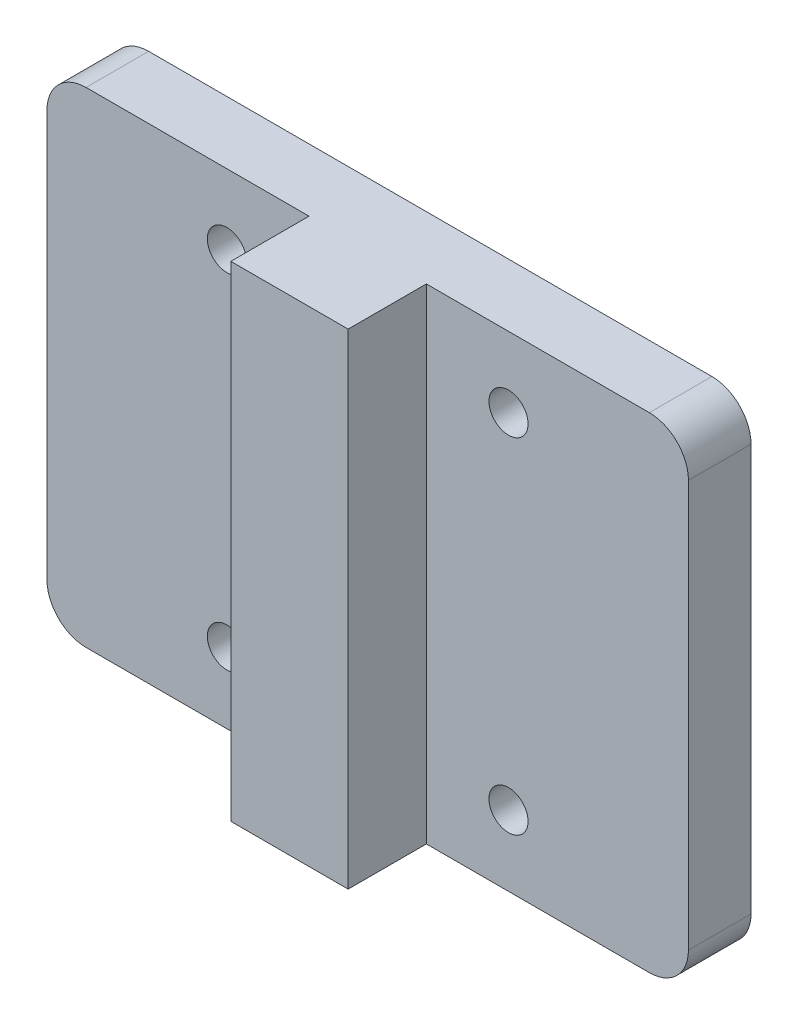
ISO-10303-21;
HEADER;
FILE_DESCRIPTION(('STEP AP214'),'2;1');
FILE_NAME('part.step','',(''),(''),'','','');
FILE_SCHEMA(('AUTOMOTIVE_DESIGN { 1 0 10303 214 1 1 1 1 }'));
ENDSEC;
DATA;
#1=APPLICATION_CONTEXT('core data for automotive mechanical design processes');
#2=APPLICATION_PROTOCOL_DEFINITION('international standard','automotive_design',2000,#1);
#3=PRODUCT_CONTEXT('',#1,'mechanical');
#4=PRODUCT('Part','Part','',(#3));
#5=PRODUCT_RELATED_PRODUCT_CATEGORY('part','',(#4));
#6=PRODUCT_DEFINITION_FORMATION('','',#4);
#7=PRODUCT_DEFINITION_CONTEXT('part definition',#1,'design');
#8=PRODUCT_DEFINITION('design','',#6,#7);
#9=PRODUCT_DEFINITION_SHAPE('','',#8);
#10=(LENGTH_UNIT() NAMED_UNIT(*) SI_UNIT(.MILLI.,.METRE.));
#11=(NAMED_UNIT(*) PLANE_ANGLE_UNIT() SI_UNIT($,.RADIAN.));
#12=(NAMED_UNIT(*) SI_UNIT($,.STERADIAN.) SOLID_ANGLE_UNIT());
#13=UNCERTAINTY_MEASURE_WITH_UNIT(LENGTH_MEASURE(1.E-05),#10,'distance_accuracy_value','');
#14=(GEOMETRIC_REPRESENTATION_CONTEXT(3) GLOBAL_UNCERTAINTY_ASSIGNED_CONTEXT((#13)) GLOBAL_UNIT_ASSIGNED_CONTEXT((#10,
#11,#12)) REPRESENTATION_CONTEXT('',''));
#15=CARTESIAN_POINT('',(0.,0.,0.));
#16=DIRECTION('',(0.,0.,1.));
#17=DIRECTION('',(1.,0.,0.));
#18=AXIS2_PLACEMENT_3D('',#15,#16,#17);
#19=CARTESIAN_POINT('',(0.,0.,0.));
#20=DIRECTION('',(0.,0.,-1.));
#21=DIRECTION('',(-1.,0.,0.));
#22=AXIS2_PLACEMENT_3D('',#19,#20,#21);
#23=PLANE('',#22);
#24=CARTESIAN_POINT('',(-76.592247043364,0.554599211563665,0.));
#25=DIRECTION('',(0.,0.,1.));
#26=DIRECTION('',(1.,0.,0.));
#27=AXIS2_PLACEMENT_3D('',#24,#25,#26);
#28=CIRCLE('',#27,2.5);
#29=CARTESIAN_POINT('',(-74.092247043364,0.554599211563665,0.));
#30=VERTEX_POINT('',#29);
#31=EDGE_CURVE('E176',#30,#30,#28,.T.);
#32=ORIENTED_EDGE('',*,*,#31,.F.);
#33=EDGE_LOOP('',(#32));
#34=FACE_BOUND('',#33,.T.);
#35=CARTESIAN_POINT('',(-76.592247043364,44.5545992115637,0.));
#36=DIRECTION('',(0.,0.,1.));
#37=DIRECTION('',(1.,0.,0.));
#38=AXIS2_PLACEMENT_3D('',#35,#36,#37);
#39=CIRCLE('',#38,2.5);
#40=CARTESIAN_POINT('',(-74.092247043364,44.5545992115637,0.));
#41=VERTEX_POINT('',#40);
#42=EDGE_CURVE('E167',#41,#41,#39,.T.);
#43=ORIENTED_EDGE('',*,*,#42,.F.);
#44=EDGE_LOOP('',(#43));
#45=FACE_BOUND('',#44,.T.);
#46=DIRECTION('',(0.,-1.,0.));
#47=VECTOR('',#46,1.);
#48=CARTESIAN_POINT('',(-66.092247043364,53.5545992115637,0.));
#49=LINE('',#48,#47);
#50=CARTESIAN_POINT('',(-66.0922470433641,53.5545992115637,0.));
#51=VERTEX_POINT('',#50);
#52=CARTESIAN_POINT('',(-66.0922470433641,-8.44540078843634,0.));
#53=VERTEX_POINT('',#52);
#54=EDGE_CURVE('E128',#51,#53,#49,.T.);
#55=ORIENTED_EDGE('',*,*,#54,.F.);
#56=DIRECTION('',(-1.,0.,0.));
#57=VECTOR('',#56,1.);
#58=CARTESIAN_POINT('',(-99.592247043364,53.5545992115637,0.));
#59=LINE('',#58,#57);
#60=CARTESIAN_POINT('',(-94.592247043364,53.5545992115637,0.));
#61=VERTEX_POINT('',#60);
#62=EDGE_CURVE('E129',#51,#61,#59,.T.);
#63=ORIENTED_EDGE('',*,*,#62,.T.);
#64=CARTESIAN_POINT('',(-94.592247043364,48.5545992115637,0.));
#65=DIRECTION('',(0.,0.,-1.));
#66=DIRECTION('',(-1.,0.,0.));
#67=AXIS2_PLACEMENT_3D('',#64,#65,#66);
#68=CIRCLE('',#67,5.);
#69=CARTESIAN_POINT('',(-99.592247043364,48.5545992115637,0.));
#70=VERTEX_POINT('',#69);
#71=EDGE_CURVE('E316',#61,#70,#68,.F.);
#72=ORIENTED_EDGE('',*,*,#71,.T.);
#73=DIRECTION('',(0.,-1.,0.));
#74=VECTOR('',#73,1.);
#75=CARTESIAN_POINT('',(-99.592247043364,53.5545992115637,0.));
#76=LINE('',#75,#74);
#77=CARTESIAN_POINT('',(-99.592247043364,-3.44540078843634,0.));
#78=VERTEX_POINT('',#77);
#79=EDGE_CURVE('E276',#70,#78,#76,.T.);
#80=ORIENTED_EDGE('',*,*,#79,.T.);
#81=CARTESIAN_POINT('',(-94.592247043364,-3.44540078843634,0.));
#82=DIRECTION('',(0.,0.,-1.));
#83=DIRECTION('',(-1.,0.,0.));
#84=AXIS2_PLACEMENT_3D('',#81,#82,#83);
#85=CIRCLE('',#84,5.);
#86=CARTESIAN_POINT('',(-94.592247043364,-8.44540078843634,0.));
#87=VERTEX_POINT('',#86);
#88=EDGE_CURVE('E320',#78,#87,#85,.F.);
#89=ORIENTED_EDGE('',*,*,#88,.T.);
#90=DIRECTION('',(1.,0.,0.));
#91=VECTOR('',#90,1.);
#92=CARTESIAN_POINT('',(-99.592247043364,-8.44540078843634,0.));
#93=LINE('',#92,#91);
#94=EDGE_CURVE('E41',#87,#53,#93,.T.);
#95=ORIENTED_EDGE('',*,*,#94,.T.);
#96=EDGE_LOOP('',(#55,#63,#72,#80,#89,#95));
#97=FACE_BOUND('',#96,.T.);
#98=ADVANCED_FACE('F16',(#34,#45,#97),#23,.F.);
#99=CARTESIAN_POINT('',(-40.592247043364,0.554599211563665,0.));
#100=DIRECTION('',(0.,0.,1.));
#101=DIRECTION('',(1.,0.,0.));
#102=AXIS2_PLACEMENT_3D('',#99,#100,#101);
#103=CIRCLE('',#102,2.5);
#104=CARTESIAN_POINT('',(-38.092247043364,0.554599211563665,0.));
#105=VERTEX_POINT('',#104);
#106=EDGE_CURVE('E182',#105,#105,#103,.T.);
#107=ORIENTED_EDGE('',*,*,#106,.F.);
#108=EDGE_LOOP('',(#107));
#109=FACE_BOUND('',#108,.T.);
#110=CARTESIAN_POINT('',(-40.592247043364,44.5545992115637,0.));
#111=DIRECTION('',(0.,0.,1.));
#112=DIRECTION('',(1.,0.,0.));
#113=AXIS2_PLACEMENT_3D('',#110,#111,#112);
#114=CIRCLE('',#113,2.5);
#115=CARTESIAN_POINT('',(-38.092247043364,44.5545992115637,0.));
#116=VERTEX_POINT('',#115);
#117=EDGE_CURVE('E170',#116,#116,#114,.T.);
#118=ORIENTED_EDGE('',*,*,#117,.F.);
#119=EDGE_LOOP('',(#118));
#120=FACE_BOUND('',#119,.T.);
#121=DIRECTION('',(0.,1.,0.));
#122=VECTOR('',#121,1.);
#123=CARTESIAN_POINT('',(-51.092247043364,53.5545992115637,0.));
#124=LINE('',#123,#122);
#125=CARTESIAN_POINT('',(-51.0922470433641,-8.44540078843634,0.));
#126=VERTEX_POINT('',#125);
#127=CARTESIAN_POINT('',(-51.092247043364,53.5545992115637,0.));
#128=VERTEX_POINT('',#127);
#129=EDGE_CURVE('E33',#126,#128,#124,.T.);
#130=ORIENTED_EDGE('',*,*,#129,.F.);
#131=CARTESIAN_POINT('',(-22.592247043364,-8.44540078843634,0.));
#132=VERTEX_POINT('',#131);
#133=EDGE_CURVE('E155',#126,#132,#93,.T.);
#134=ORIENTED_EDGE('',*,*,#133,.T.);
#135=CARTESIAN_POINT('',(-22.592247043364,-3.44540078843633,0.));
#136=DIRECTION('',(0.,0.,-1.));
#137=DIRECTION('',(-1.,0.,0.));
#138=AXIS2_PLACEMENT_3D('',#135,#136,#137);
#139=CIRCLE('',#138,5.);
#140=CARTESIAN_POINT('',(-17.592247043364,-3.44540078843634,0.));
#141=VERTEX_POINT('',#140);
#142=EDGE_CURVE('E291',#132,#141,#139,.F.);
#143=ORIENTED_EDGE('',*,*,#142,.T.);
#144=DIRECTION('',(0.,1.,0.));
#145=VECTOR('',#144,1.);
#146=CARTESIAN_POINT('',(-17.592247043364,53.5545992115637,0.));
#147=LINE('',#146,#145);
#148=CARTESIAN_POINT('',(-17.592247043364,48.5545992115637,0.));
#149=VERTEX_POINT('',#148);
#150=EDGE_CURVE('E286',#141,#149,#147,.T.);
#151=ORIENTED_EDGE('',*,*,#150,.T.);
#152=CARTESIAN_POINT('',(-22.592247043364,48.5545992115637,0.));
#153=DIRECTION('',(0.,0.,-1.));
#154=DIRECTION('',(-1.,0.,0.));
#155=AXIS2_PLACEMENT_3D('',#152,#153,#154);
#156=CIRCLE('',#155,5.);
#157=CARTESIAN_POINT('',(-22.592247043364,53.5545992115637,0.));
#158=VERTEX_POINT('',#157);
#159=EDGE_CURVE('E296',#149,#158,#156,.F.);
#160=ORIENTED_EDGE('',*,*,#159,.T.);
#161=EDGE_CURVE('E131',#158,#128,#59,.T.);
#162=ORIENTED_EDGE('',*,*,#161,.T.);
#163=EDGE_LOOP('',(#130,#134,#143,#151,#160,#162));
#164=FACE_BOUND('',#163,.T.);
#165=ADVANCED_FACE('F188',(#109,#120,#164),#23,.F.);
#166=CARTESIAN_POINT('',(-99.592247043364,53.5545992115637,-8.));
#167=DIRECTION('',(0.,1.,0.));
#168=DIRECTION('',(0.,0.,1.));
#169=AXIS2_PLACEMENT_3D('',#166,#167,#168);
#170=PLANE('',#169);
#171=DIRECTION('',(-1.,0.,0.));
#172=VECTOR('',#171,1.);
#173=CARTESIAN_POINT('',(-99.592247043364,53.5545992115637,-8.));
#174=LINE('',#173,#172);
#175=CARTESIAN_POINT('',(-22.592247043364,53.5545992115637,-8.));
#176=VERTEX_POINT('',#175);
#177=CARTESIAN_POINT('',(-94.592247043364,53.5545992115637,-8.));
#178=VERTEX_POINT('',#177);
#179=EDGE_CURVE('E150',#176,#178,#174,.T.);
#180=ORIENTED_EDGE('',*,*,#179,.T.);
#181=DIRECTION('',(0.,0.,1.));
#182=VECTOR('',#181,1.);
#183=CARTESIAN_POINT('',(-94.592247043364,53.5545992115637,-8.));
#184=LINE('',#183,#182);
#185=EDGE_CURVE('E297',#178,#61,#184,.T.);
#186=ORIENTED_EDGE('',*,*,#185,.T.);
#187=ORIENTED_EDGE('',*,*,#62,.F.);
#188=DIRECTION('',(0.,0.,-1.));
#189=VECTOR('',#188,1.);
#190=CARTESIAN_POINT('',(-66.092247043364,53.5545992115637,10.));
#191=LINE('',#190,#189);
#192=CARTESIAN_POINT('',(-66.092247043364,53.5545992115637,10.));
#193=VERTEX_POINT('',#192);
#194=EDGE_CURVE('E143',#193,#51,#191,.T.);
#195=ORIENTED_EDGE('',*,*,#194,.F.);
#196=DIRECTION('',(-1.,0.,0.));
#197=VECTOR('',#196,1.);
#198=CARTESIAN_POINT('',(-66.092247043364,53.5545992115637,10.));
#199=LINE('',#198,#197);
#200=CARTESIAN_POINT('',(-51.092247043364,53.5545992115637,10.));
#201=VERTEX_POINT('',#200);
#202=EDGE_CURVE('E122',#201,#193,#199,.T.);
#203=ORIENTED_EDGE('',*,*,#202,.F.);
#204=DIRECTION('',(0.,0.,-1.));
#205=VECTOR('',#204,1.);
#206=CARTESIAN_POINT('',(-51.092247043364,53.5545992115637,10.));
#207=LINE('',#206,#205);
#208=EDGE_CURVE('E133',#201,#128,#207,.T.);
#209=ORIENTED_EDGE('',*,*,#208,.T.);
#210=ORIENTED_EDGE('',*,*,#161,.F.);
#211=DIRECTION('',(0.,0.,1.));
#212=VECTOR('',#211,1.);
#213=CARTESIAN_POINT('',(-22.592247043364,53.5545992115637,-8.));
#214=LINE('',#213,#212);
#215=EDGE_CURVE('E254',#158,#176,#214,.F.);
#216=ORIENTED_EDGE('',*,*,#215,.T.);
#217=EDGE_LOOP('',(#180,#186,#187,#195,#203,#209,#210,#216));
#218=FACE_BOUND('',#217,.T.);
#219=ADVANCED_FACE('F191',(#218),#170,.T.);
#220=CARTESIAN_POINT('',(-17.592247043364,53.5545992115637,-8.));
#221=DIRECTION('',(1.,0.,0.));
#222=DIRECTION('',(0.,0.,-1.));
#223=AXIS2_PLACEMENT_3D('',#220,#221,#222);
#224=PLANE('',#223);
#225=DIRECTION('',(0.,1.,0.));
#226=VECTOR('',#225,1.);
#227=CARTESIAN_POINT('',(-17.592247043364,53.5545992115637,-8.));
#228=LINE('',#227,#226);
#229=CARTESIAN_POINT('',(-17.592247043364,-3.44540078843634,-8.));
#230=VERTEX_POINT('',#229);
#231=CARTESIAN_POINT('',(-17.592247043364,48.5545992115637,-8.));
#232=VERTEX_POINT('',#231);
#233=EDGE_CURVE('E280',#230,#232,#228,.T.);
#234=ORIENTED_EDGE('',*,*,#233,.T.);
#235=DIRECTION('',(0.,0.,1.));
#236=VECTOR('',#235,1.);
#237=CARTESIAN_POINT('',(-17.592247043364,48.5545992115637,-8.));
#238=LINE('',#237,#236);
#239=EDGE_CURVE('E11',#232,#149,#238,.T.);
#240=ORIENTED_EDGE('',*,*,#239,.T.);
#241=ORIENTED_EDGE('',*,*,#150,.F.);
#242=DIRECTION('',(0.,0.,1.));
#243=VECTOR('',#242,1.);
#244=CARTESIAN_POINT('',(-17.592247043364,-3.44540078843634,-8.));
#245=LINE('',#244,#243);
#246=EDGE_CURVE('E25',#141,#230,#245,.F.);
#247=ORIENTED_EDGE('',*,*,#246,.T.);
#248=EDGE_LOOP('',(#234,#240,#241,#247));
#249=FACE_BOUND('',#248,.T.);
#250=ADVANCED_FACE('F223',(#249),#224,.T.);
#251=CARTESIAN_POINT('',(-99.592247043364,-8.44540078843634,-8.));
#252=DIRECTION('',(0.,-1.,0.));
#253=DIRECTION('',(0.,0.,-1.));
#254=AXIS2_PLACEMENT_3D('',#251,#252,#253);
#255=PLANE('',#254);
#256=ORIENTED_EDGE('',*,*,#94,.F.);
#257=DIRECTION('',(0.,0.,1.));
#258=VECTOR('',#257,1.);
#259=CARTESIAN_POINT('',(-94.592247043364,-8.44540078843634,-8.));
#260=LINE('',#259,#258);
#261=CARTESIAN_POINT('',(-94.592247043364,-8.44540078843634,-8.));
#262=VERTEX_POINT('',#261);
#263=EDGE_CURVE('E272',#87,#262,#260,.F.);
#264=ORIENTED_EDGE('',*,*,#263,.T.);
#265=DIRECTION('',(1.,0.,0.));
#266=VECTOR('',#265,1.);
#267=CARTESIAN_POINT('',(-99.592247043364,-8.44540078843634,-8.));
#268=LINE('',#267,#266);
#269=CARTESIAN_POINT('',(-22.592247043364,-8.44540078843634,-8.));
#270=VERTEX_POINT('',#269);
#271=EDGE_CURVE('E301',#262,#270,#268,.T.);
#272=ORIENTED_EDGE('',*,*,#271,.T.);
#273=DIRECTION('',(0.,0.,1.));
#274=VECTOR('',#273,1.);
#275=CARTESIAN_POINT('',(-22.592247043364,-8.44540078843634,-8.));
#276=LINE('',#275,#274);
#277=EDGE_CURVE('E269',#270,#132,#276,.T.);
#278=ORIENTED_EDGE('',*,*,#277,.T.);
#279=ORIENTED_EDGE('',*,*,#133,.F.);
#280=DIRECTION('',(0.,0.,-1.));
#281=VECTOR('',#280,1.);
#282=CARTESIAN_POINT('',(-51.092247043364,-8.44540078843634,10.));
#283=LINE('',#282,#281);
#284=CARTESIAN_POINT('',(-51.092247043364,-8.44540078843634,10.));
#285=VERTEX_POINT('',#284);
#286=EDGE_CURVE('E113',#285,#126,#283,.T.);
#287=ORIENTED_EDGE('',*,*,#286,.F.);
#288=DIRECTION('',(1.,0.,0.));
#289=VECTOR('',#288,1.);
#290=CARTESIAN_POINT('',(-66.092247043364,-8.44540078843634,10.));
#291=LINE('',#290,#289);
#292=CARTESIAN_POINT('',(-66.092247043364,-8.44540078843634,10.));
#293=VERTEX_POINT('',#292);
#294=EDGE_CURVE('E106',#293,#285,#291,.T.);
#295=ORIENTED_EDGE('',*,*,#294,.F.);
#296=DIRECTION('',(0.,0.,-1.));
#297=VECTOR('',#296,1.);
#298=CARTESIAN_POINT('',(-66.092247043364,-8.44540078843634,10.));
#299=LINE('',#298,#297);
#300=EDGE_CURVE('E110',#293,#53,#299,.T.);
#301=ORIENTED_EDGE('',*,*,#300,.T.);
#302=EDGE_LOOP('',(#256,#264,#272,#278,#279,#287,#295,#301));
#303=FACE_BOUND('',#302,.T.);
#304=ADVANCED_FACE('F108',(#303),#255,.T.);
#305=CARTESIAN_POINT('',(-99.592247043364,53.5545992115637,-8.));
#306=DIRECTION('',(-1.,0.,0.));
#307=DIRECTION('',(0.,0.,1.));
#308=AXIS2_PLACEMENT_3D('',#305,#306,#307);
#309=PLANE('',#308);
#310=ORIENTED_EDGE('',*,*,#79,.F.);
#311=DIRECTION('',(0.,0.,1.));
#312=VECTOR('',#311,1.);
#313=CARTESIAN_POINT('',(-99.592247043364,48.5545992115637,-8.));
#314=LINE('',#313,#312);
#315=CARTESIAN_POINT('',(-99.592247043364,48.5545992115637,-8.));
#316=VERTEX_POINT('',#315);
#317=EDGE_CURVE('E264',#70,#316,#314,.F.);
#318=ORIENTED_EDGE('',*,*,#317,.T.);
#319=DIRECTION('',(0.,-1.,0.));
#320=VECTOR('',#319,1.);
#321=CARTESIAN_POINT('',(-99.592247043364,53.5545992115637,-8.));
#322=LINE('',#321,#320);
#323=CARTESIAN_POINT('',(-99.592247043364,-3.44540078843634,-8.));
#324=VERTEX_POINT('',#323);
#325=EDGE_CURVE('E304',#316,#324,#322,.T.);
#326=ORIENTED_EDGE('',*,*,#325,.T.);
#327=DIRECTION('',(0.,0.,1.));
#328=VECTOR('',#327,1.);
#329=CARTESIAN_POINT('',(-99.592247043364,-3.44540078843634,-8.));
#330=LINE('',#329,#328);
#331=EDGE_CURVE('E323',#324,#78,#330,.T.);
#332=ORIENTED_EDGE('',*,*,#331,.T.);
#333=EDGE_LOOP('',(#310,#318,#326,#332));
#334=FACE_BOUND('',#333,.T.);
#335=ADVANCED_FACE('F229',(#334),#309,.T.);
#336=CARTESIAN_POINT('',(0.,0.,-8.));
#337=DIRECTION('',(0.,0.,-1.));
#338=DIRECTION('',(-1.,0.,0.));
#339=AXIS2_PLACEMENT_3D('',#336,#337,#338);
#340=PLANE('',#339);
#341=CARTESIAN_POINT('',(-40.592247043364,0.554599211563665,-8.));
#342=DIRECTION('',(0.,0.,-1.));
#343=DIRECTION('',(-1.,0.,0.));
#344=AXIS2_PLACEMENT_3D('',#341,#342,#343);
#345=CIRCLE('',#344,2.5);
#346=CARTESIAN_POINT('',(-43.092247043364,0.554599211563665,-8.));
#347=VERTEX_POINT('',#346);
#348=EDGE_CURVE('E179',#347,#347,#345,.T.);
#349=ORIENTED_EDGE('',*,*,#348,.F.);
#350=EDGE_LOOP('',(#349));
#351=FACE_BOUND('',#350,.T.);
#352=CARTESIAN_POINT('',(-76.592247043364,0.554599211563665,-8.));
#353=DIRECTION('',(0.,0.,-1.));
#354=DIRECTION('',(-1.,0.,0.));
#355=AXIS2_PLACEMENT_3D('',#352,#353,#354);
#356=CIRCLE('',#355,2.5);
#357=CARTESIAN_POINT('',(-79.092247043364,0.554599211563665,-8.));
#358=VERTEX_POINT('',#357);
#359=EDGE_CURVE('E173',#358,#358,#356,.T.);
#360=ORIENTED_EDGE('',*,*,#359,.F.);
#361=EDGE_LOOP('',(#360));
#362=FACE_BOUND('',#361,.T.);
#363=CARTESIAN_POINT('',(-40.592247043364,44.5545992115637,-8.));
#364=DIRECTION('',(0.,0.,-1.));
#365=DIRECTION('',(-1.,0.,0.));
#366=AXIS2_PLACEMENT_3D('',#363,#364,#365);
#367=CIRCLE('',#366,2.5);
#368=CARTESIAN_POINT('',(-43.092247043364,44.5545992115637,-8.));
#369=VERTEX_POINT('',#368);
#370=EDGE_CURVE('E20',#369,#369,#367,.T.);
#371=ORIENTED_EDGE('',*,*,#370,.F.);
#372=EDGE_LOOP('',(#371));
#373=FACE_BOUND('',#372,.T.);
#374=CARTESIAN_POINT('',(-76.592247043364,44.5545992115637,-8.));
#375=DIRECTION('',(0.,0.,-1.));
#376=DIRECTION('',(-1.,0.,0.));
#377=AXIS2_PLACEMENT_3D('',#374,#375,#376);
#378=CIRCLE('',#377,2.5);
#379=CARTESIAN_POINT('',(-79.092247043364,44.5545992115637,-8.));
#380=VERTEX_POINT('',#379);
#381=EDGE_CURVE('E142',#380,#380,#378,.T.);
#382=ORIENTED_EDGE('',*,*,#381,.F.);
#383=EDGE_LOOP('',(#382));
#384=FACE_BOUND('',#383,.T.);
#385=ORIENTED_EDGE('',*,*,#325,.F.);
#386=CARTESIAN_POINT('',(-94.592247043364,48.5545992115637,-8.));
#387=DIRECTION('',(0.,0.,-1.));
#388=DIRECTION('',(-1.,0.,0.));
#389=AXIS2_PLACEMENT_3D('',#386,#387,#388);
#390=CIRCLE('',#389,5.);
#391=EDGE_CURVE('E262',#316,#178,#390,.T.);
#392=ORIENTED_EDGE('',*,*,#391,.T.);
#393=ORIENTED_EDGE('',*,*,#179,.F.);
#394=CARTESIAN_POINT('',(-22.592247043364,48.5545992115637,-8.));
#395=DIRECTION('',(0.,0.,-1.));
#396=DIRECTION('',(-1.,0.,0.));
#397=AXIS2_PLACEMENT_3D('',#394,#395,#396);
#398=CIRCLE('',#397,5.);
#399=EDGE_CURVE('E253',#176,#232,#398,.T.);
#400=ORIENTED_EDGE('',*,*,#399,.T.);
#401=ORIENTED_EDGE('',*,*,#233,.F.);
#402=CARTESIAN_POINT('',(-22.592247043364,-3.44540078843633,-8.));
#403=DIRECTION('',(0.,0.,-1.));
#404=DIRECTION('',(-1.,0.,0.));
#405=AXIS2_PLACEMENT_3D('',#402,#403,#404);
#406=CIRCLE('',#405,5.);
#407=EDGE_CURVE('E260',#230,#270,#406,.T.);
#408=ORIENTED_EDGE('',*,*,#407,.T.);
#409=ORIENTED_EDGE('',*,*,#271,.F.);
#410=CARTESIAN_POINT('',(-94.592247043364,-3.44540078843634,-8.));
#411=DIRECTION('',(0.,0.,-1.));
#412=DIRECTION('',(-1.,0.,0.));
#413=AXIS2_PLACEMENT_3D('',#410,#411,#412);
#414=CIRCLE('',#413,5.);
#415=EDGE_CURVE('E259',#262,#324,#414,.T.);
#416=ORIENTED_EDGE('',*,*,#415,.T.);
#417=EDGE_LOOP('',(#385,#392,#393,#400,#401,#408,#409,#416));
#418=FACE_BOUND('',#417,.T.);
#419=ADVANCED_FACE('F221',(#351,#362,#373,#384,#418),#340,.T.);
#420=CARTESIAN_POINT('',(-94.592247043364,48.5545992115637,-8.));
#421=DIRECTION('',(0.,0.,1.));
#422=DIRECTION('',(1.,0.,0.));
#423=AXIS2_PLACEMENT_3D('',#420,#421,#422);
#424=CYLINDRICAL_SURFACE('',#423,5.);
#425=ORIENTED_EDGE('',*,*,#391,.F.);
#426=ORIENTED_EDGE('',*,*,#317,.F.);
#427=ORIENTED_EDGE('',*,*,#71,.F.);
#428=ORIENTED_EDGE('',*,*,#185,.F.);
#429=EDGE_LOOP('',(#425,#426,#427,#428));
#430=FACE_BOUND('',#429,.T.);
#431=ADVANCED_FACE('F235',(#430),#424,.T.);
#432=CARTESIAN_POINT('',(-94.592247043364,-3.44540078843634,-8.));
#433=DIRECTION('',(0.,0.,1.));
#434=DIRECTION('',(1.,0.,0.));
#435=AXIS2_PLACEMENT_3D('',#432,#433,#434);
#436=CYLINDRICAL_SURFACE('',#435,5.);
#437=ORIENTED_EDGE('',*,*,#415,.F.);
#438=ORIENTED_EDGE('',*,*,#263,.F.);
#439=ORIENTED_EDGE('',*,*,#88,.F.);
#440=ORIENTED_EDGE('',*,*,#331,.F.);
#441=EDGE_LOOP('',(#437,#438,#439,#440));
#442=FACE_BOUND('',#441,.T.);
#443=ADVANCED_FACE('F238',(#442),#436,.T.);
#444=CARTESIAN_POINT('',(-22.592247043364,48.5545992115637,-8.));
#445=DIRECTION('',(0.,0.,1.));
#446=DIRECTION('',(1.,0.,0.));
#447=AXIS2_PLACEMENT_3D('',#444,#445,#446);
#448=CYLINDRICAL_SURFACE('',#447,5.);
#449=ORIENTED_EDGE('',*,*,#399,.F.);
#450=ORIENTED_EDGE('',*,*,#215,.F.);
#451=ORIENTED_EDGE('',*,*,#159,.F.);
#452=ORIENTED_EDGE('',*,*,#239,.F.);
#453=EDGE_LOOP('',(#449,#450,#451,#452));
#454=FACE_BOUND('',#453,.T.);
#455=ADVANCED_FACE('F241',(#454),#448,.T.);
#456=CARTESIAN_POINT('',(-22.592247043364,-3.44540078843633,-8.));
#457=DIRECTION('',(0.,0.,1.));
#458=DIRECTION('',(1.,0.,0.));
#459=AXIS2_PLACEMENT_3D('',#456,#457,#458);
#460=CYLINDRICAL_SURFACE('',#459,5.);
#461=ORIENTED_EDGE('',*,*,#407,.F.);
#462=ORIENTED_EDGE('',*,*,#246,.F.);
#463=ORIENTED_EDGE('',*,*,#142,.F.);
#464=ORIENTED_EDGE('',*,*,#277,.F.);
#465=EDGE_LOOP('',(#461,#462,#463,#464));
#466=FACE_BOUND('',#465,.T.);
#467=ADVANCED_FACE('F18',(#466),#460,.T.);
#468=CARTESIAN_POINT('',(-66.092247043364,53.5545992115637,10.));
#469=DIRECTION('',(1.,0.,0.));
#470=DIRECTION('',(0.,0.,-1.));
#471=AXIS2_PLACEMENT_3D('',#468,#469,#470);
#472=PLANE('',#471);
#473=ORIENTED_EDGE('',*,*,#54,.T.);
#474=ORIENTED_EDGE('',*,*,#300,.F.);
#475=DIRECTION('',(0.,-1.,0.));
#476=VECTOR('',#475,1.);
#477=CARTESIAN_POINT('',(-66.092247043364,53.5545992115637,10.));
#478=LINE('',#477,#476);
#479=EDGE_CURVE('E117',#193,#293,#478,.T.);
#480=ORIENTED_EDGE('',*,*,#479,.F.);
#481=ORIENTED_EDGE('',*,*,#194,.T.);
#482=EDGE_LOOP('',(#473,#474,#480,#481));
#483=FACE_BOUND('',#482,.T.);
#484=ADVANCED_FACE('F127',(#483),#472,.F.);
#485=CARTESIAN_POINT('',(-51.092247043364,53.5545992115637,10.));
#486=DIRECTION('',(-1.,0.,0.));
#487=DIRECTION('',(0.,0.,1.));
#488=AXIS2_PLACEMENT_3D('',#485,#486,#487);
#489=PLANE('',#488);
#490=ORIENTED_EDGE('',*,*,#129,.T.);
#491=ORIENTED_EDGE('',*,*,#208,.F.);
#492=DIRECTION('',(0.,1.,0.));
#493=VECTOR('',#492,1.);
#494=CARTESIAN_POINT('',(-51.092247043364,53.5545992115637,10.));
#495=LINE('',#494,#493);
#496=EDGE_CURVE('E116',#285,#201,#495,.T.);
#497=ORIENTED_EDGE('',*,*,#496,.F.);
#498=ORIENTED_EDGE('',*,*,#286,.T.);
#499=EDGE_LOOP('',(#490,#491,#497,#498));
#500=FACE_BOUND('',#499,.T.);
#501=ADVANCED_FACE('F375',(#500),#489,.F.);
#502=CARTESIAN_POINT('',(0.,0.,10.));
#503=DIRECTION('',(0.,0.,1.));
#504=DIRECTION('',(1.,0.,0.));
#505=AXIS2_PLACEMENT_3D('',#502,#503,#504);
#506=PLANE('',#505);
#507=ORIENTED_EDGE('',*,*,#479,.T.);
#508=ORIENTED_EDGE('',*,*,#294,.T.);
#509=ORIENTED_EDGE('',*,*,#496,.T.);
#510=ORIENTED_EDGE('',*,*,#202,.T.);
#511=EDGE_LOOP('',(#507,#508,#509,#510));
#512=FACE_BOUND('',#511,.T.);
#513=ADVANCED_FACE('F120',(#512),#506,.T.);
#514=CARTESIAN_POINT('',(-76.592247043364,44.5545992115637,0.));
#515=DIRECTION('',(0.,0.,1.));
#516=DIRECTION('',(1.,0.,0.));
#517=AXIS2_PLACEMENT_3D('',#514,#515,#516);
#518=CYLINDRICAL_SURFACE('',#517,2.5);
#519=ORIENTED_EDGE('',*,*,#381,.T.);
#520=EDGE_LOOP('',(#519));
#521=FACE_BOUND('',#520,.T.);
#522=ORIENTED_EDGE('',*,*,#42,.T.);
#523=EDGE_LOOP('',(#522));
#524=FACE_BOUND('',#523,.T.);
#525=ADVANCED_FACE('F198',(#521,#524),#518,.F.);
#526=CARTESIAN_POINT('',(-40.592247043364,44.5545992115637,0.));
#527=DIRECTION('',(0.,0.,1.));
#528=DIRECTION('',(1.,0.,0.));
#529=AXIS2_PLACEMENT_3D('',#526,#527,#528);
#530=CYLINDRICAL_SURFACE('',#529,2.5);
#531=ORIENTED_EDGE('',*,*,#370,.T.);
#532=EDGE_LOOP('',(#531));
#533=FACE_BOUND('',#532,.T.);
#534=ORIENTED_EDGE('',*,*,#117,.T.);
#535=EDGE_LOOP('',(#534));
#536=FACE_BOUND('',#535,.T.);
#537=ADVANCED_FACE('F195',(#533,#536),#530,.F.);
#538=CARTESIAN_POINT('',(-76.592247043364,0.554599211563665,0.));
#539=DIRECTION('',(0.,0.,1.));
#540=DIRECTION('',(1.,0.,0.));
#541=AXIS2_PLACEMENT_3D('',#538,#539,#540);
#542=CYLINDRICAL_SURFACE('',#541,2.5);
#543=ORIENTED_EDGE('',*,*,#359,.T.);
#544=EDGE_LOOP('',(#543));
#545=FACE_BOUND('',#544,.T.);
#546=ORIENTED_EDGE('',*,*,#31,.T.);
#547=EDGE_LOOP('',(#546));
#548=FACE_BOUND('',#547,.T.);
#549=ADVANCED_FACE('F197',(#545,#548),#542,.F.);
#550=CARTESIAN_POINT('',(-40.592247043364,0.554599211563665,0.));
#551=DIRECTION('',(0.,0.,1.));
#552=DIRECTION('',(1.,0.,0.));
#553=AXIS2_PLACEMENT_3D('',#550,#551,#552);
#554=CYLINDRICAL_SURFACE('',#553,2.5);
#555=ORIENTED_EDGE('',*,*,#348,.T.);
#556=EDGE_LOOP('',(#555));
#557=FACE_BOUND('',#556,.T.);
#558=ORIENTED_EDGE('',*,*,#106,.T.);
#559=EDGE_LOOP('',(#558));
#560=FACE_BOUND('',#559,.T.);
#561=ADVANCED_FACE('F186',(#557,#560),#554,.F.);
#562=CLOSED_SHELL('',(#98,#165,#219,#250,#304,#335,#419,#431,#443,#455,#467,#484,#501,#513,#525,
#537,#549,#561));
#563=MANIFOLD_SOLID_BREP('B1',#562);
#564=ADVANCED_BREP_SHAPE_REPRESENTATION('',(#18,#563),#14);
#565=SHAPE_DEFINITION_REPRESENTATION(#9,#564);
ENDSEC;
END-ISO-10303-21;
